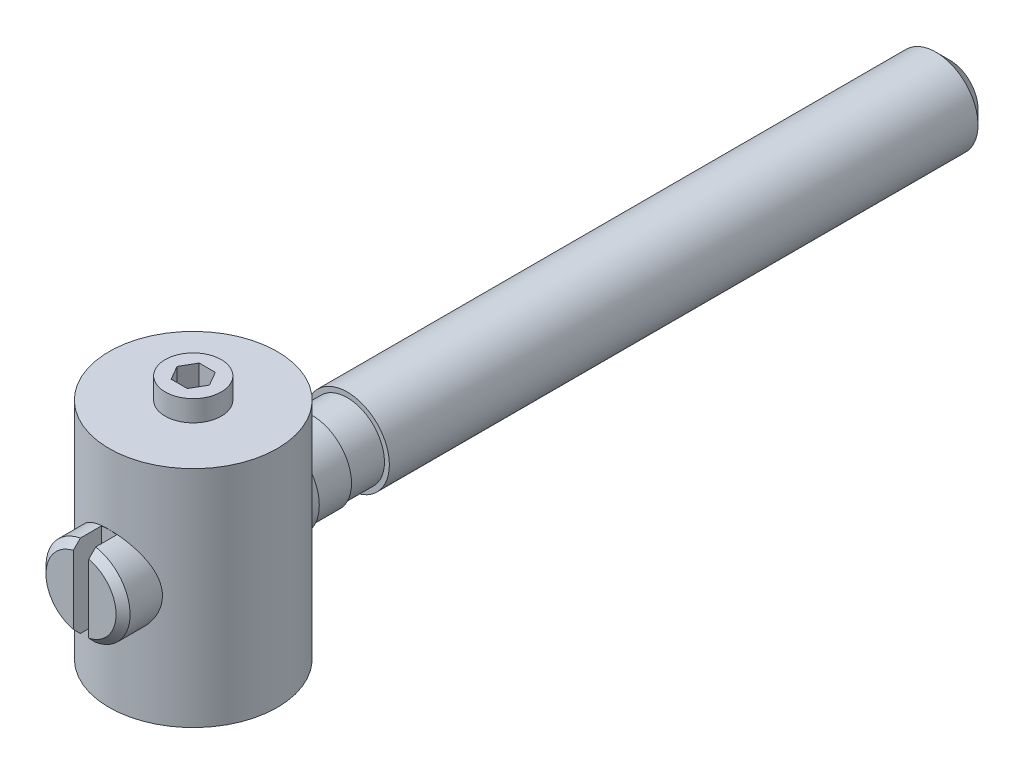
ISO-10303-21;
HEADER;
FILE_DESCRIPTION(('STEP AP214'),'2;1');
FILE_NAME('part.step','',(''),(''),'','','');
FILE_SCHEMA(('AUTOMOTIVE_DESIGN { 1 0 10303 214 1 1 1 1 }'));
ENDSEC;
DATA;
#1=APPLICATION_CONTEXT('core data for automotive mechanical design processes');
#2=APPLICATION_PROTOCOL_DEFINITION('international standard','automotive_design',2000,#1);
#3=PRODUCT_CONTEXT('',#1,'mechanical');
#4=PRODUCT('Part','Part','',(#3));
#5=PRODUCT_RELATED_PRODUCT_CATEGORY('part','',(#4));
#6=PRODUCT_DEFINITION_FORMATION('','',#4);
#7=PRODUCT_DEFINITION_CONTEXT('part definition',#1,'design');
#8=PRODUCT_DEFINITION('design','',#6,#7);
#9=PRODUCT_DEFINITION_SHAPE('','',#8);
#10=(LENGTH_UNIT() NAMED_UNIT(*) SI_UNIT(.MILLI.,.METRE.));
#11=(NAMED_UNIT(*) PLANE_ANGLE_UNIT() SI_UNIT($,.RADIAN.));
#12=(NAMED_UNIT(*) SI_UNIT($,.STERADIAN.) SOLID_ANGLE_UNIT());
#13=UNCERTAINTY_MEASURE_WITH_UNIT(LENGTH_MEASURE(1.E-05),#10,'distance_accuracy_value','');
#14=(GEOMETRIC_REPRESENTATION_CONTEXT(3) GLOBAL_UNCERTAINTY_ASSIGNED_CONTEXT((#13)) GLOBAL_UNIT_ASSIGNED_CONTEXT((#10,
#11,#12)) REPRESENTATION_CONTEXT('',''));
#15=CARTESIAN_POINT('',(0.,0.,0.));
#16=DIRECTION('',(0.,0.,1.));
#17=DIRECTION('',(1.,0.,0.));
#18=AXIS2_PLACEMENT_3D('',#15,#16,#17);
#19=CARTESIAN_POINT('',(-0.577350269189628,8.,-1.));
#20=DIRECTION('',(0.,-1.,0.));
#21=DIRECTION('',(1.,0.,0.));
#22=AXIS2_PLACEMENT_3D('',#19,#20,#21);
#23=PLANE('',#22);
#24=DIRECTION('',(-0.5,0.,0.866025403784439));
#25=VECTOR('',#24,1.);
#26=CARTESIAN_POINT('',(-0.577350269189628,8.,-1.));
#27=LINE('',#26,#25);
#28=CARTESIAN_POINT('',(-0.577350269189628,8.,-1.));
#29=VERTEX_POINT('',#28);
#30=CARTESIAN_POINT('',(-1.15470053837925,8.,0.));
#31=VERTEX_POINT('',#30);
#32=EDGE_CURVE('E366',#29,#31,#27,.T.);
#33=ORIENTED_EDGE('',*,*,#32,.T.);
#34=DIRECTION('',(0.5,0.,0.866025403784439));
#35=VECTOR('',#34,1.);
#36=CARTESIAN_POINT('',(-1.15470053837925,8.,0.));
#37=LINE('',#36,#35);
#38=CARTESIAN_POINT('',(-0.577350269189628,8.,1.));
#39=VERTEX_POINT('',#38);
#40=EDGE_CURVE('E363',#31,#39,#37,.T.);
#41=ORIENTED_EDGE('',*,*,#40,.T.);
#42=DIRECTION('',(1.,0.,0.));
#43=VECTOR('',#42,1.);
#44=CARTESIAN_POINT('',(-0.577350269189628,8.,1.));
#45=LINE('',#44,#43);
#46=CARTESIAN_POINT('',(0.577350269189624,8.,1.));
#47=VERTEX_POINT('',#46);
#48=EDGE_CURVE('E360',#39,#47,#45,.T.);
#49=ORIENTED_EDGE('',*,*,#48,.T.);
#50=DIRECTION('',(0.5,0.,-0.866025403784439));
#51=VECTOR('',#50,1.);
#52=CARTESIAN_POINT('',(0.577350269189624,8.,1.));
#53=LINE('',#52,#51);
#54=CARTESIAN_POINT('',(1.15470053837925,8.,0.));
#55=VERTEX_POINT('',#54);
#56=EDGE_CURVE('E357',#47,#55,#53,.T.);
#57=ORIENTED_EDGE('',*,*,#56,.T.);
#58=DIRECTION('',(-0.5,0.,-0.866025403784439));
#59=VECTOR('',#58,1.);
#60=CARTESIAN_POINT('',(1.15470053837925,8.,0.));
#61=LINE('',#60,#59);
#62=CARTESIAN_POINT('',(0.577350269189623,8.,-1.));
#63=VERTEX_POINT('',#62);
#64=EDGE_CURVE('E354',#55,#63,#61,.T.);
#65=ORIENTED_EDGE('',*,*,#64,.T.);
#66=DIRECTION('',(-1.,0.,0.));
#67=VECTOR('',#66,1.);
#68=CARTESIAN_POINT('',(0.577350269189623,8.,-1.));
#69=LINE('',#68,#67);
#70=EDGE_CURVE('E342',#63,#29,#69,.T.);
#71=ORIENTED_EDGE('',*,*,#70,.T.);
#72=EDGE_LOOP('',(#33,#41,#49,#57,#65,#71));
#73=FACE_BOUND('',#72,.T.);
#74=ADVANCED_FACE('F14',(#73),#23,.F.);
#75=CARTESIAN_POINT('',(-0.577350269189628,8.,1.));
#76=DIRECTION('',(0.,0.,1.));
#77=DIRECTION('',(1.,0.,0.));
#78=AXIS2_PLACEMENT_3D('',#75,#76,#77);
#79=PLANE('',#78);
#80=DIRECTION('',(1.,0.,0.));
#81=VECTOR('',#80,1.);
#82=CARTESIAN_POINT('',(-0.577350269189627,9.5,1.));
#83=LINE('',#82,#81);
#84=CARTESIAN_POINT('',(-0.577350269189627,9.5,1.));
#85=VERTEX_POINT('',#84);
#86=CARTESIAN_POINT('',(0.577350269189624,9.5,1.));
#87=VERTEX_POINT('',#86);
#88=EDGE_CURVE('E378',#85,#87,#83,.T.);
#89=ORIENTED_EDGE('',*,*,#88,.T.);
#90=DIRECTION('',(0.,1.,0.));
#91=VECTOR('',#90,1.);
#92=CARTESIAN_POINT('',(0.577350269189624,8.,1.));
#93=LINE('',#92,#91);
#94=EDGE_CURVE('E345',#47,#87,#93,.T.);
#95=ORIENTED_EDGE('',*,*,#94,.F.);
#96=ORIENTED_EDGE('',*,*,#48,.F.);
#97=DIRECTION('',(0.,1.,0.));
#98=VECTOR('',#97,1.);
#99=CARTESIAN_POINT('',(-0.577350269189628,8.,1.));
#100=LINE('',#99,#98);
#101=EDGE_CURVE('E343',#39,#85,#100,.T.);
#102=ORIENTED_EDGE('',*,*,#101,.T.);
#103=EDGE_LOOP('',(#89,#95,#96,#102));
#104=FACE_BOUND('',#103,.T.);
#105=ADVANCED_FACE('F615',(#104),#79,.F.);
#106=CARTESIAN_POINT('',(0.577350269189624,8.,1.));
#107=DIRECTION('',(0.866025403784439,0.,0.5));
#108=DIRECTION('',(0.5,0.,-0.866025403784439));
#109=AXIS2_PLACEMENT_3D('',#106,#107,#108);
#110=PLANE('',#109);
#111=DIRECTION('',(0.5,0.,-0.866025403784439));
#112=VECTOR('',#111,1.);
#113=CARTESIAN_POINT('',(0.577350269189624,9.5,1.));
#114=LINE('',#113,#112);
#115=CARTESIAN_POINT('',(1.15470053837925,9.5,0.));
#116=VERTEX_POINT('',#115);
#117=EDGE_CURVE('E375',#87,#116,#114,.T.);
#118=ORIENTED_EDGE('',*,*,#117,.T.);
#119=DIRECTION('',(0.,1.,0.));
#120=VECTOR('',#119,1.);
#121=CARTESIAN_POINT('',(1.15470053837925,8.,0.));
#122=LINE('',#121,#120);
#123=EDGE_CURVE('E347',#55,#116,#122,.T.);
#124=ORIENTED_EDGE('',*,*,#123,.F.);
#125=ORIENTED_EDGE('',*,*,#56,.F.);
#126=ORIENTED_EDGE('',*,*,#94,.T.);
#127=EDGE_LOOP('',(#118,#124,#125,#126));
#128=FACE_BOUND('',#127,.T.);
#129=ADVANCED_FACE('F624',(#128),#110,.F.);
#130=CARTESIAN_POINT('',(1.15470053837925,8.,0.));
#131=DIRECTION('',(0.866025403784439,0.,-0.5));
#132=DIRECTION('',(-0.5,0.,-0.866025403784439));
#133=AXIS2_PLACEMENT_3D('',#130,#131,#132);
#134=PLANE('',#133);
#135=DIRECTION('',(-0.5,0.,-0.866025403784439));
#136=VECTOR('',#135,1.);
#137=CARTESIAN_POINT('',(1.15470053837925,9.5,0.));
#138=LINE('',#137,#136);
#139=CARTESIAN_POINT('',(0.577350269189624,9.5,-1.));
#140=VERTEX_POINT('',#139);
#141=EDGE_CURVE('E372',#116,#140,#138,.T.);
#142=ORIENTED_EDGE('',*,*,#141,.T.);
#143=DIRECTION('',(0.,1.,0.));
#144=VECTOR('',#143,1.);
#145=CARTESIAN_POINT('',(0.577350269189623,8.,-1.));
#146=LINE('',#145,#144);
#147=EDGE_CURVE('E349',#63,#140,#146,.T.);
#148=ORIENTED_EDGE('',*,*,#147,.F.);
#149=ORIENTED_EDGE('',*,*,#64,.F.);
#150=ORIENTED_EDGE('',*,*,#123,.T.);
#151=EDGE_LOOP('',(#142,#148,#149,#150));
#152=FACE_BOUND('',#151,.T.);
#153=ADVANCED_FACE('F634',(#152),#134,.F.);
#154=CARTESIAN_POINT('',(0.577350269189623,8.,-1.));
#155=DIRECTION('',(0.,0.,-1.));
#156=DIRECTION('',(-1.,0.,0.));
#157=AXIS2_PLACEMENT_3D('',#154,#155,#156);
#158=PLANE('',#157);
#159=DIRECTION('',(-1.,0.,0.));
#160=VECTOR('',#159,1.);
#161=CARTESIAN_POINT('',(0.577350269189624,9.5,-1.));
#162=LINE('',#161,#160);
#163=CARTESIAN_POINT('',(-0.577350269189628,9.5,-1.));
#164=VERTEX_POINT('',#163);
#165=EDGE_CURVE('E369',#140,#164,#162,.T.);
#166=ORIENTED_EDGE('',*,*,#165,.T.);
#167=DIRECTION('',(0.,1.,0.));
#168=VECTOR('',#167,1.);
#169=CARTESIAN_POINT('',(-0.577350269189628,8.,-1.));
#170=LINE('',#169,#168);
#171=EDGE_CURVE('E337',#29,#164,#170,.T.);
#172=ORIENTED_EDGE('',*,*,#171,.F.);
#173=ORIENTED_EDGE('',*,*,#70,.F.);
#174=ORIENTED_EDGE('',*,*,#147,.T.);
#175=EDGE_LOOP('',(#166,#172,#173,#174));
#176=FACE_BOUND('',#175,.T.);
#177=ADVANCED_FACE('F644',(#176),#158,.F.);
#178=CARTESIAN_POINT('',(-0.577350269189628,8.,-1.));
#179=DIRECTION('',(-0.866025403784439,0.,-0.5));
#180=DIRECTION('',(-0.5,0.,0.866025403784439));
#181=AXIS2_PLACEMENT_3D('',#178,#179,#180);
#182=PLANE('',#181);
#183=DIRECTION('',(-0.5,0.,0.866025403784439));
#184=VECTOR('',#183,1.);
#185=CARTESIAN_POINT('',(-0.577350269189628,9.5,-1.));
#186=LINE('',#185,#184);
#187=CARTESIAN_POINT('',(-1.15470053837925,9.5,0.));
#188=VERTEX_POINT('',#187);
#189=EDGE_CURVE('E87',#164,#188,#186,.T.);
#190=ORIENTED_EDGE('',*,*,#189,.T.);
#191=DIRECTION('',(0.,1.,0.));
#192=VECTOR('',#191,1.);
#193=CARTESIAN_POINT('',(-1.15470053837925,8.,0.));
#194=LINE('',#193,#192);
#195=EDGE_CURVE('E340',#31,#188,#194,.T.);
#196=ORIENTED_EDGE('',*,*,#195,.F.);
#197=ORIENTED_EDGE('',*,*,#32,.F.);
#198=ORIENTED_EDGE('',*,*,#171,.T.);
#199=EDGE_LOOP('',(#190,#196,#197,#198));
#200=FACE_BOUND('',#199,.T.);
#201=ADVANCED_FACE('F654',(#200),#182,.F.);
#202=CARTESIAN_POINT('',(-1.15470053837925,8.,0.));
#203=DIRECTION('',(-0.866025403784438,0.,0.5));
#204=DIRECTION('',(0.5,0.,0.866025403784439));
#205=AXIS2_PLACEMENT_3D('',#202,#203,#204);
#206=PLANE('',#205);
#207=DIRECTION('',(0.5,0.,0.866025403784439));
#208=VECTOR('',#207,1.);
#209=CARTESIAN_POINT('',(-1.15470053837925,9.5,0.));
#210=LINE('',#209,#208);
#211=EDGE_CURVE('E381',#188,#85,#210,.T.);
#212=ORIENTED_EDGE('',*,*,#211,.T.);
#213=ORIENTED_EDGE('',*,*,#101,.F.);
#214=ORIENTED_EDGE('',*,*,#40,.F.);
#215=ORIENTED_EDGE('',*,*,#195,.T.);
#216=EDGE_LOOP('',(#212,#213,#214,#215));
#217=FACE_BOUND('',#216,.T.);
#218=ADVANCED_FACE('F663',(#217),#206,.F.);
#219=CARTESIAN_POINT('',(0.,9.5,0.));
#220=DIRECTION('',(0.,-1.,0.));
#221=DIRECTION('',(1.,0.,0.));
#222=AXIS2_PLACEMENT_3D('',#219,#220,#221);
#223=PLANE('',#222);
#224=ORIENTED_EDGE('',*,*,#211,.F.);
#225=ORIENTED_EDGE('',*,*,#189,.F.);
#226=ORIENTED_EDGE('',*,*,#165,.F.);
#227=ORIENTED_EDGE('',*,*,#141,.F.);
#228=ORIENTED_EDGE('',*,*,#117,.F.);
#229=ORIENTED_EDGE('',*,*,#88,.F.);
#230=EDGE_LOOP('',(#224,#225,#226,#227,#228,#229));
#231=FACE_BOUND('',#230,.T.);
#232=CARTESIAN_POINT('',(0.,9.5,0.));
#233=DIRECTION('',(0.,-1.,0.));
#234=DIRECTION('',(1.,0.,0.));
#235=AXIS2_PLACEMENT_3D('',#232,#233,#234);
#236=CIRCLE('',#235,2.);
#237=CARTESIAN_POINT('',(2.,9.5,0.));
#238=VERTEX_POINT('',#237);
#239=EDGE_CURVE('E332',#238,#238,#236,.T.);
#240=ORIENTED_EDGE('',*,*,#239,.F.);
#241=EDGE_LOOP('',(#240));
#242=FACE_BOUND('',#241,.T.);
#243=ADVANCED_FACE('F409',(#231,#242),#223,.F.);
#244=CARTESIAN_POINT('',(0.,5.5,0.));
#245=DIRECTION('',(0.,-1.,0.));
#246=DIRECTION('',(1.,0.,0.));
#247=AXIS2_PLACEMENT_3D('',#244,#245,#246);
#248=CYLINDRICAL_SURFACE('',#247,2.);
#249=ORIENTED_EDGE('',*,*,#239,.T.);
#250=EDGE_LOOP('',(#249));
#251=FACE_BOUND('',#250,.T.);
#252=CARTESIAN_POINT('',(0.,8.,0.));
#253=DIRECTION('',(0.,-1.,0.));
#254=DIRECTION('',(1.,0.,0.));
#255=AXIS2_PLACEMENT_3D('',#252,#253,#254);
#256=CIRCLE('',#255,2.);
#257=CARTESIAN_POINT('',(2.,8.,0.));
#258=VERTEX_POINT('',#257);
#259=EDGE_CURVE('E330',#258,#258,#256,.T.);
#260=ORIENTED_EDGE('',*,*,#259,.F.);
#261=EDGE_LOOP('',(#260));
#262=FACE_BOUND('',#261,.T.);
#263=ADVANCED_FACE('F403',(#251,#262),#248,.T.);
#264=CARTESIAN_POINT('',(0.,8.,0.));
#265=DIRECTION('',(0.,-1.,0.));
#266=DIRECTION('',(1.,0.,0.));
#267=AXIS2_PLACEMENT_3D('',#264,#265,#266);
#268=PLANE('',#267);
#269=CARTESIAN_POINT('',(0.,8.,0.));
#270=DIRECTION('',(0.,-1.,0.));
#271=DIRECTION('',(1.,0.,0.));
#272=AXIS2_PLACEMENT_3D('',#269,#270,#271);
#273=CIRCLE('',#272,6.);
#274=CARTESIAN_POINT('',(6.,8.,0.));
#275=VERTEX_POINT('',#274);
#276=EDGE_CURVE('E387',#275,#275,#273,.T.);
#277=ORIENTED_EDGE('',*,*,#276,.F.);
#278=EDGE_LOOP('',(#277));
#279=FACE_BOUND('',#278,.T.);
#280=ORIENTED_EDGE('',*,*,#259,.T.);
#281=EDGE_LOOP('',(#280));
#282=FACE_BOUND('',#281,.T.);
#283=ADVANCED_FACE('F397',(#279,#282),#268,.F.);
#284=CARTESIAN_POINT('',(0.,-8.,0.));
#285=DIRECTION('',(0.,-1.,0.));
#286=DIRECTION('',(1.,0.,0.));
#287=AXIS2_PLACEMENT_3D('',#284,#285,#286);
#288=PLANE('',#287);
#289=CARTESIAN_POINT('',(0.,-8.,0.));
#290=DIRECTION('',(0.,-1.,0.));
#291=DIRECTION('',(1.,0.,0.));
#292=AXIS2_PLACEMENT_3D('',#289,#290,#291);
#293=CIRCLE('',#292,6.);
#294=CARTESIAN_POINT('',(6.,-8.,0.));
#295=VERTEX_POINT('',#294);
#296=EDGE_CURVE('E385',#295,#295,#293,.T.);
#297=ORIENTED_EDGE('',*,*,#296,.T.);
#298=EDGE_LOOP('',(#297));
#299=FACE_BOUND('',#298,.T.);
#300=ADVANCED_FACE('F257',(#299),#288,.T.);
#301=CARTESIAN_POINT('',(0.,-8.,0.));
#302=DIRECTION('',(0.,1.,0.));
#303=DIRECTION('',(-1.,0.,0.));
#304=AXIS2_PLACEMENT_3D('',#301,#302,#303);
#305=CYLINDRICAL_SURFACE('',#304,6.);
#306=CARTESIAN_POINT('',(0.,-3.,6.));
#307=CARTESIAN_POINT('',(0.0788941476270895,-2.99999916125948,5.99999934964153));
#308=CARTESIAN_POINT('',(0.157796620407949,-2.99688205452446,5.99843869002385));
#309=CARTESIAN_POINT('',(0.315001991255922,-2.98446072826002,5.99224358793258));
#310=CARTESIAN_POINT('',(0.393304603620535,-2.97515372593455,5.98760776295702));
#311=CARTESIAN_POINT('',(0.626628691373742,-2.93804214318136,5.96921978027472));
#312=CARTESIAN_POINT('',(0.779952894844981,-2.90104717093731,5.95098734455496));
#313=CARTESIAN_POINT('',(1.07683586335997,-2.80441822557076,5.90448966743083));
#314=CARTESIAN_POINT('',(1.22043005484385,-2.74487223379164,5.87626344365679));
#315=CARTESIAN_POINT('',(1.49540820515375,-2.60528874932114,5.81237302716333));
#316=CARTESIAN_POINT('',(1.62679312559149,-2.52525287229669,5.77670942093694));
#317=CARTESIAN_POINT('',(1.88252701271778,-2.34144601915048,5.69868752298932));
#318=CARTESIAN_POINT('',(2.0059694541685,-2.23653205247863,5.65605474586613));
#319=CARTESIAN_POINT('',(2.23433451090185,-2.00844407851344,5.5698003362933));
#320=CARTESIAN_POINT('',(2.3392430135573,-1.88525628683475,5.52617797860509));
#321=CARTESIAN_POINT('',(2.53576864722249,-1.61251563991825,5.43896347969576));
#322=CARTESIAN_POINT('',(2.62572411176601,-1.46165902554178,5.39563602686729));
#323=CARTESIAN_POINT('',(2.7403403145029,-1.22404914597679,5.33782449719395));
#324=CARTESIAN_POINT('',(2.77516786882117,-1.14292907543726,5.31974570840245));
#325=CARTESIAN_POINT('',(2.83769299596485,-0.977399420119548,5.28665768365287));
#326=CARTESIAN_POINT('',(2.86539478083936,-0.892991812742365,5.27164663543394));
#327=CARTESIAN_POINT('',(2.91188280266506,-0.72660420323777,5.24610341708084));
#328=CARTESIAN_POINT('',(2.93110042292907,-0.644777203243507,5.23535838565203));
#329=CARTESIAN_POINT('',(2.9626355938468,-0.4794450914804,5.21757784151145));
#330=CARTESIAN_POINT('',(2.97495680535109,-0.395940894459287,5.21054036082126));
#331=CARTESIAN_POINT('',(2.99251382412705,-0.227993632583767,5.20047756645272));
#332=CARTESIAN_POINT('',(2.99775389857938,-0.143551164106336,5.19744983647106));
#333=CARTESIAN_POINT('',(3.00108452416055,0.0254936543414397,5.19552555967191));
#334=CARTESIAN_POINT('',(2.99917575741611,0.110095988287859,5.19662861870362));
#335=CARTESIAN_POINT('',(2.98404973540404,0.342753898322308,5.20534668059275));
#336=CARTESIAN_POINT('',(2.96335042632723,0.490244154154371,5.21726794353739));
#337=CARTESIAN_POINT('',(2.90082280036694,0.779193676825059,5.25228182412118));
#338=CARTESIAN_POINT('',(2.85898775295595,0.920651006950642,5.2753780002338));
#339=CARTESIAN_POINT('',(2.75462843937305,1.19767965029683,5.33062568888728));
#340=CARTESIAN_POINT('',(2.69164495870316,1.33303711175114,5.36297559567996));
#341=CARTESIAN_POINT('',(2.54712530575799,1.59190496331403,5.43310175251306));
#342=CARTESIAN_POINT('',(2.46558080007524,1.71540999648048,5.47088043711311));
#343=CARTESIAN_POINT('',(2.27419808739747,1.96356309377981,5.55339485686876));
#344=CARTESIAN_POINT('',(2.16208335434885,2.0863704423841,5.59840533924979));
#345=CARTESIAN_POINT('',(1.91866675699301,2.31220643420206,5.6864286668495));
#346=CARTESIAN_POINT('',(1.78735577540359,2.41522562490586,5.72944054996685));
#347=CARTESIAN_POINT('',(1.50154951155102,2.60305693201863,5.81105962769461));
#348=CARTESIAN_POINT('',(1.3462607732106,2.68680140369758,5.84936952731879));
#349=CARTESIAN_POINT('',(1.02139864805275,2.82629110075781,5.91473643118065));
#350=CARTESIAN_POINT('',(0.851836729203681,2.88205855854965,5.94180236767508));
#351=CARTESIAN_POINT('',(0.518299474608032,2.95942620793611,5.97973001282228));
#352=CARTESIAN_POINT('',(0.355024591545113,2.98347370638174,5.99174814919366));
#353=CARTESIAN_POINT('',(0.0263387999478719,3.00439419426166,6.00219040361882));
#354=CARTESIAN_POINT('',(-0.13907105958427,3.00128005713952,6.00062096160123));
#355=CARTESIAN_POINT('',(-0.453698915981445,2.96937993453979,5.98473576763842));
#356=CARTESIAN_POINT('',(-0.60317822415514,2.94260240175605,5.97141737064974));
#357=CARTESIAN_POINT('',(-0.895220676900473,2.86728578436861,5.93466513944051));
#358=CARTESIAN_POINT('',(-1.03778305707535,2.81874430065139,5.91123019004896));
#359=CARTESIAN_POINT('',(-1.31666582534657,2.7000046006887,5.85552754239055));
#360=CARTESIAN_POINT('',(-1.45269119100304,2.62922684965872,5.82302645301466));
#361=CARTESIAN_POINT('',(-1.71138408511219,2.46867739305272,5.75231922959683));
#362=CARTESIAN_POINT('',(-1.83404588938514,2.37889759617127,5.71411066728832));
#363=CARTESIAN_POINT('',(-2.07530306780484,2.17271872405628,5.63124663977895));
#364=CARTESIAN_POINT('',(-2.19231623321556,2.05457139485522,5.58632654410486));
#365=CARTESIAN_POINT('',(-2.40556896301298,1.8002245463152,5.49787174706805));
#366=CARTESIAN_POINT('',(-2.50179415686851,1.66401264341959,5.45433802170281));
#367=CARTESIAN_POINT('',(-2.675123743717,1.36906903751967,5.3715357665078));
#368=CARTESIAN_POINT('',(-2.75107648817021,1.20956620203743,5.33257588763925));
#369=CARTESIAN_POINT('',(-2.87424847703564,0.87746979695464,5.26722216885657));
#370=CARTESIAN_POINT('',(-2.92150474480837,0.704893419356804,5.24081214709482));
#371=CARTESIAN_POINT('',(-2.98158506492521,0.369269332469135,5.2068450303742));
#372=CARTESIAN_POINT('',(-2.997278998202,0.206897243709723,5.19772150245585));
#373=CARTESIAN_POINT('',(-3.00206745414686,-0.118341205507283,5.19496064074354));
#374=CARTESIAN_POINT('',(-2.99117350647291,-0.28120732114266,5.20131659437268));
#375=CARTESIAN_POINT('',(-2.94577840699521,-0.586450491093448,5.227135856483));
#376=CARTESIAN_POINT('',(-2.91362505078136,-0.72930136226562,5.24529281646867));
#377=CARTESIAN_POINT('',(-2.82952596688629,-1.0074244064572,5.29113050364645));
#378=CARTESIAN_POINT('',(-2.77757387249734,-1.14269412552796,5.3188142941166));
#379=CARTESIAN_POINT('',(-2.65144766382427,-1.41187436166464,5.38285583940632));
#380=CARTESIAN_POINT('',(-2.57601505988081,-1.54508296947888,5.41967139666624));
#381=CARTESIAN_POINT('',(-2.40645126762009,-1.7978243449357,5.49706022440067));
#382=CARTESIAN_POINT('',(-2.31231035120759,-1.9173499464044,5.5376354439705));
#383=CARTESIAN_POINT('',(-2.094616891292,-2.15442285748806,5.62386853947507));
#384=CARTESIAN_POINT('',(-1.96888052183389,-2.26996512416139,5.66954494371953));
#385=CARTESIAN_POINT('',(-1.69843715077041,-2.47880114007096,5.75633712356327));
#386=CARTESIAN_POINT('',(-1.55371998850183,-2.57208289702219,5.79745043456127));
#387=CARTESIAN_POINT('',(-1.32452333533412,-2.69317818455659,5.85251406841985));
#388=CARTESIAN_POINT('',(-1.24575314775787,-2.73052020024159,5.86982524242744));
#389=CARTESIAN_POINT('',(-1.08479725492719,-2.79836167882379,5.90168845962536));
#390=CARTESIAN_POINT('',(-1.00261324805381,-2.82886449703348,5.91624185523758));
#391=CARTESIAN_POINT('',(-0.835616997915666,-2.88260725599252,5.94212690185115));
#392=CARTESIAN_POINT('',(-0.750810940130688,-2.90586304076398,5.95346557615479));
#393=CARTESIAN_POINT('',(-0.579142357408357,-2.94488257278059,5.97260771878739));
#394=CARTESIAN_POINT('',(-0.492281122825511,-2.96065089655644,5.9804133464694));
#395=CARTESIAN_POINT('',(-0.337824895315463,-2.98168467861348,5.99085829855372));
#396=CARTESIAN_POINT('',(-0.270495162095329,-2.98854691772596,5.99428035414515));
#397=CARTESIAN_POINT('',(-0.13544567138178,-2.99770500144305,5.99885151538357));
#398=CARTESIAN_POINT('',(-0.067725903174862,-3.00000072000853,6.00000055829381));
#399=CARTESIAN_POINT('',(0.,-3.,6.));
#400=B_SPLINE_CURVE_WITH_KNOTS('',3,(#306,#307,#308,#309,#310,#311,#312,#313,#314,#315,#316,
#317,#318,#319,#320,#321,#322,#323,#324,#325,#326,#327,#328,#329,#330,#331,#332,#333,#334,#335,
#336,#337,#338,#339,#340,#341,#342,#343,#344,#345,#346,#347,#348,#349,#350,#351,#352,#353,#354,
#355,#356,#357,#358,#359,#360,#361,#362,#363,#364,#365,#366,#367,#368,#369,#370,#371,#372,#373,
#374,#375,#376,#377,#378,#379,#380,#381,#382,#383,#384,#385,#386,#387,#388,#389,#390,#391,#392,
#393,#394,#395,#396,#397,#398,#399),.UNSPECIFIED.,.T.,.F.,(4,2,2,2,2,2,2,2,2,2,2,2,2,2,2,2,2,2,
2,2,2,2,2,2,2,2,2,2,2,2,2,2,2,2,2,2,2,2,2,2,2,2,2,2,2,2,4),(0.,0.236611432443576,
0.4733293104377,0.947100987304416,1.41904300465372,1.89094781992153,2.39140181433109,
2.89223525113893,3.4319083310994,3.70192714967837,3.97178599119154,4.22563720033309,
4.47935352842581,4.73291689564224,4.98645606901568,5.43238672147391,5.87845946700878,
6.33492255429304,6.79159098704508,7.30616358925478,7.82098138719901,8.35970601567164,
8.89800185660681,9.39171406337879,9.88519228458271,10.3404225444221,10.7957029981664,
11.2640010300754,11.7324988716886,12.2470036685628,12.7618630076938,13.3016558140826,
13.8407507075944,14.3280945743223,14.8152271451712,15.2559532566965,15.6968212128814,
16.1673090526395,16.6380421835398,17.1659726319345,17.6941868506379,17.9605054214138,
18.2266930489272,18.4922945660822,18.7577335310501,18.9608446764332,19.1639614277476),.UNSPECIFIED.);
#401=CARTESIAN_POINT('',(0.,-3.,6.));
#402=VERTEX_POINT('',#401);
#403=EDGE_CURVE('E238',#402,#402,#400,.T.);
#404=ORIENTED_EDGE('',*,*,#403,.F.);
#405=EDGE_LOOP('',(#404));
#406=FACE_BOUND('',#405,.T.);
#407=ORIENTED_EDGE('',*,*,#296,.F.);
#408=EDGE_LOOP('',(#407));
#409=FACE_BOUND('',#408,.T.);
#410=ORIENTED_EDGE('',*,*,#276,.T.);
#411=EDGE_LOOP('',(#410));
#412=FACE_BOUND('',#411,.T.);
#413=CARTESIAN_POINT('',(-0.249443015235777,-2.98961171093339,-5.99481260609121));
#414=CARTESIAN_POINT('',(-0.330004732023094,-2.98290238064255,-5.99147459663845));
#415=CARTESIAN_POINT('',(-0.410210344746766,-2.9729193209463,-5.9864967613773));
#416=CARTESIAN_POINT('',(-0.569274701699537,-2.94659155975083,-5.97346181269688));
#417=CARTESIAN_POINT('',(-0.648134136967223,-2.93025023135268,-5.96540633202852));
#418=CARTESIAN_POINT('',(-0.803591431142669,-2.89147571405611,-5.94645720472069));
#419=CARTESIAN_POINT('',(-0.880198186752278,-2.86907155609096,-5.93557709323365));
#420=CARTESIAN_POINT('',(-1.03101013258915,-2.81839560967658,-5.91124875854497));
#421=CARTESIAN_POINT('',(-1.10521507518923,-2.79012321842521,-5.89780027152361));
#422=CARTESIAN_POINT('',(-1.3232618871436,-2.6970128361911,-5.85413093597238));
#423=CARTESIAN_POINT('',(-1.46294865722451,-2.62377717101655,-5.82053324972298));
#424=CARTESIAN_POINT('',(-1.72813965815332,-2.45726165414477,-5.74739463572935));
#425=CARTESIAN_POINT('',(-1.85362624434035,-2.36395727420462,-5.70784645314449));
#426=CARTESIAN_POINT('',(-2.09631897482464,-2.15246230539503,-5.62343784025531));
#427=CARTESIAN_POINT('',(-2.21235682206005,-2.0329990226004,-5.57839915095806));
#428=CARTESIAN_POINT('',(-2.42343129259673,-1.77613061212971,-5.49000039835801));
#429=CARTESIAN_POINT('',(-2.51845793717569,-1.63871700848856,-5.44664114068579));
#430=CARTESIAN_POINT('',(-2.68891933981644,-1.34176609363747,-5.36461418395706));
#431=CARTESIAN_POINT('',(-2.76324651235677,-1.18150009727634,-5.32625566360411));
#432=CARTESIAN_POINT('',(-2.88302999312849,-0.848170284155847,-5.26239681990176));
#433=CARTESIAN_POINT('',(-2.92852409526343,-0.675123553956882,-5.2368796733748));
#434=CARTESIAN_POINT('',(-2.98508038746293,-0.33956679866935,-5.20482957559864));
#435=CARTESIAN_POINT('',(-2.99911195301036,-0.177715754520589,-5.19666371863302));
#436=CARTESIAN_POINT('',(-3.00080498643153,0.146144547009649,-5.19568908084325));
#437=CARTESIAN_POINT('',(-2.98847637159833,0.30815372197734,-5.20287452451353));
#438=CARTESIAN_POINT('',(-2.94054735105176,0.612110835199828,-5.23008745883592));
#439=CARTESIAN_POINT('',(-2.90718475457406,0.754536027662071,-5.24887684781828));
#440=CARTESIAN_POINT('',(-2.82077935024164,1.03164067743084,-5.29581030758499));
#441=CARTESIAN_POINT('',(-2.76773012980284,1.16631759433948,-5.32395742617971));
#442=CARTESIAN_POINT('',(-2.63918949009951,1.43470666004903,-5.38889663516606));
#443=CARTESIAN_POINT('',(-2.56236570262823,1.56766275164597,-5.4261626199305));
#444=CARTESIAN_POINT('',(-2.38999637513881,1.8196827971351,-5.5042586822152));
#445=CARTESIAN_POINT('',(-2.29444154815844,1.93873981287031,-5.5450905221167));
#446=CARTESIAN_POINT('',(-2.0738880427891,2.17441373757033,-5.63157604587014));
#447=CARTESIAN_POINT('',(-1.94673190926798,2.28902254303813,-5.67722023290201));
#448=CARTESIAN_POINT('',(-1.67350278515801,2.49573457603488,-5.76366699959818));
#449=CARTESIAN_POINT('',(-1.52741754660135,2.58782311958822,-5.80446641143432));
#450=CARTESIAN_POINT('',(-1.29660432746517,2.70672716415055,-5.85876618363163));
#451=CARTESIAN_POINT('',(-1.21754163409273,2.74321299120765,-5.87574440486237));
#452=CARTESIAN_POINT('',(-1.0560802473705,2.80932188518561,-5.90689721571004));
#453=CARTESIAN_POINT('',(-0.97368327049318,2.8389484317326,-5.9210732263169));
#454=CARTESIAN_POINT('',(-0.806386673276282,2.89091640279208,-5.94616533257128));
#455=CARTESIAN_POINT('',(-0.721494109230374,2.91327654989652,-5.95708979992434));
#456=CARTESIAN_POINT('',(-0.549753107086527,2.95050469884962,-5.9753839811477));
#457=CARTESIAN_POINT('',(-0.462906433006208,2.96537919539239,-5.98275677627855));
#458=CARTESIAN_POINT('',(-0.354542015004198,2.97905143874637,-5.98955282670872));
#459=CARTESIAN_POINT('',(-0.333551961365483,2.98147453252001,-5.99075847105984));
#460=CARTESIAN_POINT('',(-0.291530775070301,2.98587593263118,-5.99295011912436));
#461=CARTESIAN_POINT('',(-0.270499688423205,2.98785459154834,-5.99393629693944));
#462=CARTESIAN_POINT('',(-0.249443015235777,2.98961171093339,-5.99481260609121));
#463=B_SPLINE_CURVE_WITH_KNOTS('',3,(#413,#414,#415,#416,#417,#418,#419,#420,#421,#422,#423,
#424,#425,#426,#427,#428,#429,#430,#431,#432,#433,#434,#435,#436,#437,#438,#439,#440,#441,#442,
#443,#444,#445,#446,#447,#448,#449,#450,#451,#452,#453,#454,#455,#456,#457,#458,#459,#460,#461,
#462),.UNSPECIFIED.,.F.,.F.,(4,2,2,2,2,2,2,2,2,2,2,2,2,2,2,2,2,2,2,2,2,2,2,2,4),(0.,
0.242622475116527,0.485116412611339,0.726469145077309,0.967846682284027,1.4493301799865,
1.93140553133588,2.44673475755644,2.9623082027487,3.50169408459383,4.04037147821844,
4.52558194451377,5.01060989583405,5.45115857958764,5.89185089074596,6.36402161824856,
6.83642704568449,7.36553436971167,7.89498577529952,8.16082401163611,8.42652709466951,
8.6915400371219,8.9563226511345,9.01981077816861,9.08324835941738),.UNSPECIFIED.);
#464=CARTESIAN_POINT('',(-0.249443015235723,-2.98961171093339,-5.99481260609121));
#465=VERTEX_POINT('',#464);
#466=CARTESIAN_POINT('',(-0.249443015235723,2.9896117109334,-5.99481260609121));
#467=VERTEX_POINT('',#466);
#468=EDGE_CURVE('E9',#465,#467,#463,.T.);
#469=ORIENTED_EDGE('',*,*,#468,.F.);
#470=DIRECTION('',(0.,1.,0.));
#471=VECTOR('',#470,1.);
#472=CARTESIAN_POINT('',(-0.249443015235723,-8.,-5.99481260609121));
#473=LINE('',#472,#471);
#474=CARTESIAN_POINT('',(-0.2494430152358,-2.78886682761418,-5.99481260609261));
#475=VERTEX_POINT('',#474);
#476=EDGE_CURVE('E144',#475,#465,#473,.F.);
#477=ORIENTED_EDGE('',*,*,#476,.F.);
#478=CARTESIAN_POINT('',(0.249443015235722,-2.78886682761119,-5.99481260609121));
#479=CARTESIAN_POINT('',(0.228607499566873,-2.79073048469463,-5.99567959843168));
#480=CARTESIAN_POINT('',(0.207746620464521,-2.79236089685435,-5.99643870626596));
#481=CARTESIAN_POINT('',(0.166025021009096,-2.7951514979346,-5.99773876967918));
#482=CARTESIAN_POINT('',(0.1451643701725,-2.79631254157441,-5.99828012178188));
#483=CARTESIAN_POINT('',(0.103453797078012,-2.79816589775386,-5.99914472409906));
#484=CARTESIAN_POINT('',(0.0826039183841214,-2.79885901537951,-5.999468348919));
#485=CARTESIAN_POINT('',(0.0411692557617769,-2.7997729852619,-5.9998947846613));
#486=CARTESIAN_POINT('',(0.0205846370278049,-2.80000000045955,-6.00000047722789));
#487=CARTESIAN_POINT('',(-0.0209746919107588,-2.79999999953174,-5.99999951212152));
#488=CARTESIAN_POINT('',(-0.0419494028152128,-2.79976429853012,-5.99988879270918));
#489=CARTESIAN_POINT('',(-0.0836602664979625,-2.79882679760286,-5.9994506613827));
#490=CARTESIAN_POINT('',(-0.10439655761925,-2.79813004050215,-5.99912559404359));
#491=CARTESIAN_POINT('',(-0.145863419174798,-2.79627519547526,-5.99826105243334));
#492=CARTESIAN_POINT('',(-0.166593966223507,-2.79511667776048,-5.99772137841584));
#493=CARTESIAN_POINT('',(-0.208039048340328,-2.79233802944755,-5.99642770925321));
#494=CARTESIAN_POINT('',(-0.228753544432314,-2.7907174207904,-5.99567349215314));
#495=CARTESIAN_POINT('',(-0.249443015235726,-2.78886682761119,-5.99481260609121));
#496=B_SPLINE_CURVE_WITH_KNOTS('',3,(#478,#479,#480,#481,#482,#483,#484,#485,#486,#487,#488,
#489,#490,#491,#492,#493,#494,#495),.UNSPECIFIED.,.F.,.F.,(4,2,2,2,2,2,2,2,4),(0.,
0.0628083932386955,0.125501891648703,0.188087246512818,0.249839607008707,0.312762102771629,
0.375007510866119,0.437310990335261,0.499679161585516),.UNSPECIFIED.);
#497=CARTESIAN_POINT('',(0.249443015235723,-2.78886682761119,-5.99481260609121));
#498=VERTEX_POINT('',#497);
#499=EDGE_CURVE('E145',#498,#475,#496,.T.);
#500=ORIENTED_EDGE('',*,*,#499,.F.);
#501=DIRECTION('',(0.,1.,0.));
#502=VECTOR('',#501,1.);
#503=CARTESIAN_POINT('',(0.249443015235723,-8.,-5.99481260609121));
#504=LINE('',#503,#502);
#505=CARTESIAN_POINT('',(0.249443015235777,-2.98961171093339,-5.99481260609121));
#506=VERTEX_POINT('',#505);
#507=EDGE_CURVE('E274',#506,#498,#504,.T.);
#508=ORIENTED_EDGE('',*,*,#507,.F.);
#509=CARTESIAN_POINT('',(0.249443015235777,2.98961171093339,-5.99481260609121));
#510=CARTESIAN_POINT('',(0.330004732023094,2.98290238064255,-5.99147459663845));
#511=CARTESIAN_POINT('',(0.410210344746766,2.9729193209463,-5.9864967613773));
#512=CARTESIAN_POINT('',(0.569274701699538,2.94659155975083,-5.97346181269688));
#513=CARTESIAN_POINT('',(0.648134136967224,2.93025023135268,-5.96540633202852));
#514=CARTESIAN_POINT('',(0.80359143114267,2.89147571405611,-5.94645720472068));
#515=CARTESIAN_POINT('',(0.880198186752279,2.86907155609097,-5.93557709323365));
#516=CARTESIAN_POINT('',(1.03101013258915,2.81839560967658,-5.91124875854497));
#517=CARTESIAN_POINT('',(1.10521507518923,2.79012321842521,-5.89780027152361));
#518=CARTESIAN_POINT('',(1.3232618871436,2.6970128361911,-5.85413093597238));
#519=CARTESIAN_POINT('',(1.46294865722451,2.62377717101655,-5.82053324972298));
#520=CARTESIAN_POINT('',(1.72813965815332,2.45726165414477,-5.74739463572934));
#521=CARTESIAN_POINT('',(1.85362624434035,2.36395727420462,-5.70784645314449));
#522=CARTESIAN_POINT('',(2.09631897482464,2.15246230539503,-5.62343784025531));
#523=CARTESIAN_POINT('',(2.21235682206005,2.0329990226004,-5.57839915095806));
#524=CARTESIAN_POINT('',(2.42343129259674,1.77613061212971,-5.49000039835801));
#525=CARTESIAN_POINT('',(2.5184579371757,1.63871700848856,-5.44664114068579));
#526=CARTESIAN_POINT('',(2.68891933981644,1.34176609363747,-5.36461418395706));
#527=CARTESIAN_POINT('',(2.76324651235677,1.18150009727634,-5.32625566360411));
#528=CARTESIAN_POINT('',(2.88302999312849,0.848170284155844,-5.26239681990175));
#529=CARTESIAN_POINT('',(2.92852409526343,0.675123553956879,-5.2368796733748));
#530=CARTESIAN_POINT('',(2.98508038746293,0.339566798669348,-5.20482957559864));
#531=CARTESIAN_POINT('',(2.99911195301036,0.177715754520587,-5.19666371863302));
#532=CARTESIAN_POINT('',(3.00080498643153,-0.14614454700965,-5.19568908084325));
#533=CARTESIAN_POINT('',(2.98847637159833,-0.308153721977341,-5.20287452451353));
#534=CARTESIAN_POINT('',(2.94054735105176,-0.612110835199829,-5.23008745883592));
#535=CARTESIAN_POINT('',(2.90718475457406,-0.754536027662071,-5.24887684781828));
#536=CARTESIAN_POINT('',(2.82077935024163,-1.03164067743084,-5.29581030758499));
#537=CARTESIAN_POINT('',(2.76773012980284,-1.16631759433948,-5.32395742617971));
#538=CARTESIAN_POINT('',(2.63918949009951,-1.43470666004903,-5.38889663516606));
#539=CARTESIAN_POINT('',(2.56236570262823,-1.56766275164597,-5.4261626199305));
#540=CARTESIAN_POINT('',(2.3899963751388,-1.8196827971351,-5.50425868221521));
#541=CARTESIAN_POINT('',(2.29444154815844,-1.93873981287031,-5.54509052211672));
#542=CARTESIAN_POINT('',(2.0738880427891,-2.17441373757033,-5.63157604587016));
#543=CARTESIAN_POINT('',(1.94673190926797,-2.28902254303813,-5.67722023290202));
#544=CARTESIAN_POINT('',(1.673502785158,-2.49573457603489,-5.76366699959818));
#545=CARTESIAN_POINT('',(1.52741754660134,-2.58782311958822,-5.80446641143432));
#546=CARTESIAN_POINT('',(1.29660432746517,-2.70672716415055,-5.85876618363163));
#547=CARTESIAN_POINT('',(1.21754163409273,-2.74321299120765,-5.87574440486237));
#548=CARTESIAN_POINT('',(1.0560802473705,-2.80932188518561,-5.90689721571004));
#549=CARTESIAN_POINT('',(0.973683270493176,-2.8389484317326,-5.92107322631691));
#550=CARTESIAN_POINT('',(0.806386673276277,-2.89091640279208,-5.94616533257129));
#551=CARTESIAN_POINT('',(0.72149410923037,-2.91327654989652,-5.95708979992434));
#552=CARTESIAN_POINT('',(0.549753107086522,-2.95050469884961,-5.9753839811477));
#553=CARTESIAN_POINT('',(0.462906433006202,-2.96537919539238,-5.98275677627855));
#554=CARTESIAN_POINT('',(0.354542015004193,-2.97905143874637,-5.98955282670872));
#555=CARTESIAN_POINT('',(0.333551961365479,-2.98147453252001,-5.99075847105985));
#556=CARTESIAN_POINT('',(0.2915307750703,-2.98587593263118,-5.99295011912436));
#557=CARTESIAN_POINT('',(0.270499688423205,-2.98785459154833,-5.99393629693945));
#558=CARTESIAN_POINT('',(0.249443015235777,-2.98961171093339,-5.99481260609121));
#559=B_SPLINE_CURVE_WITH_KNOTS('',3,(#509,#510,#511,#512,#513,#514,#515,#516,#517,#518,#519,
#520,#521,#522,#523,#524,#525,#526,#527,#528,#529,#530,#531,#532,#533,#534,#535,#536,#537,#538,
#539,#540,#541,#542,#543,#544,#545,#546,#547,#548,#549,#550,#551,#552,#553,#554,#555,#556,#557,
#558),.UNSPECIFIED.,.F.,.F.,(4,2,2,2,2,2,2,2,2,2,2,2,2,2,2,2,2,2,2,2,2,2,2,2,4),(0.,
0.242622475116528,0.48511641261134,0.726469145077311,0.967846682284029,1.44933017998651,
1.93140553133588,2.44673475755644,2.9623082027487,3.50169408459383,4.04037147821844,
4.52558194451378,5.01060989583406,5.45115857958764,5.89185089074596,6.36402161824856,
6.8364270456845,7.36553436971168,7.89498577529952,8.16082401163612,8.42652709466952,
8.6915400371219,8.9563226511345,9.01981077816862,9.08324835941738),.UNSPECIFIED.);
#560=CARTESIAN_POINT('',(0.249443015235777,2.98961171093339,-5.99481260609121));
#561=VERTEX_POINT('',#560);
#562=EDGE_CURVE('E245',#561,#506,#559,.T.);
#563=ORIENTED_EDGE('',*,*,#562,.F.);
#564=CARTESIAN_POINT('',(0.249443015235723,2.78886682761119,-5.99481260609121));
#565=VERTEX_POINT('',#564);
#566=EDGE_CURVE('E139',#565,#561,#504,.T.);
#567=ORIENTED_EDGE('',*,*,#566,.F.);
#568=CARTESIAN_POINT('',(-0.249443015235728,2.78886682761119,-5.99481260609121));
#569=CARTESIAN_POINT('',(-0.22871534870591,2.79072083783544,-5.9956750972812));
#570=CARTESIAN_POINT('',(-0.207962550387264,2.79234401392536,-5.99642995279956));
#571=CARTESIAN_POINT('',(-0.166425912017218,2.79512708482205,-5.99772393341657));
#572=CARTESIAN_POINT('',(-0.145642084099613,2.79628712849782,-5.99826312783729));
#573=CARTESIAN_POINT('',(-0.104053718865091,2.79814331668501,-5.99912578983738));
#574=CARTESIAN_POINT('',(-0.0832491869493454,2.79883956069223,-5.99944930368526));
#575=CARTESIAN_POINT('',(-0.0416297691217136,2.79976787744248,-5.99988063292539));
#576=CARTESIAN_POINT('',(-0.0208148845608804,2.8,-5.99998847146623));
#577=CARTESIAN_POINT('',(0.0208148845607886,2.8,-5.99998847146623));
#578=CARTESIAN_POINT('',(0.0416297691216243,2.79976787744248,-5.99988063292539));
#579=CARTESIAN_POINT('',(0.0832491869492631,2.79883956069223,-5.99944930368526));
#580=CARTESIAN_POINT('',(0.104053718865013,2.79814331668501,-5.99912578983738));
#581=CARTESIAN_POINT('',(0.145642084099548,2.79628712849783,-5.99826312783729));
#582=CARTESIAN_POINT('',(0.166425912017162,2.79512708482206,-5.99772393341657));
#583=CARTESIAN_POINT('',(0.207962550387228,2.79234401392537,-5.99642995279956));
#584=CARTESIAN_POINT('',(0.228715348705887,2.79072083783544,-5.9956750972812));
#585=CARTESIAN_POINT('',(0.249443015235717,2.78886682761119,-5.99481260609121));
#586=B_SPLINE_CURVE_WITH_KNOTS('',3,(#568,#569,#570,#571,#572,#573,#574,#575,#576,#577,#578,
#579,#580,#581,#582,#583,#584,#585),.UNSPECIFIED.,.F.,.F.,(4,2,2,2,2,2,2,2,4),(0.,
0.0624832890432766,0.124946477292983,0.187396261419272,0.249839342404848,0.312282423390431,
0.374732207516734,0.437195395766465,0.499678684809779),.UNSPECIFIED.);
#587=CARTESIAN_POINT('',(-0.249443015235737,2.78886682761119,-5.99481260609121));
#588=VERTEX_POINT('',#587);
#589=EDGE_CURVE('E135',#588,#565,#586,.T.);
#590=ORIENTED_EDGE('',*,*,#589,.F.);
#591=EDGE_CURVE('E26',#467,#588,#473,.F.);
#592=ORIENTED_EDGE('',*,*,#591,.F.);
#593=EDGE_LOOP('',(#469,#477,#500,#508,#563,#567,#590,#592));
#594=FACE_BOUND('',#593,.T.);
#595=ADVANCED_FACE('F137',(#406,#409,#412,#594),#305,.T.);
#596=CARTESIAN_POINT('',(0.,0.,8.00518739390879));
#597=DIRECTION('',(0.,0.,-1.));
#598=DIRECTION('',(0.,1.,0.));
#599=AXIS2_PLACEMENT_3D('',#596,#597,#598);
#600=PLANE('',#599);
#601=CARTESIAN_POINT('',(0.,0.,8.00518739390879));
#602=DIRECTION('',(0.,0.,-1.));
#603=DIRECTION('',(0.,1.,0.));
#604=AXIS2_PLACEMENT_3D('',#601,#602,#603);
#605=CIRCLE('',#604,2.5);
#606=CARTESIAN_POINT('',(0.55,-2.43874967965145,8.00518739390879));
#607=VERTEX_POINT('',#606);
#608=CARTESIAN_POINT('',(0.55,2.43874967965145,8.00518739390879));
#609=VERTEX_POINT('',#608);
#610=EDGE_CURVE('E184',#607,#609,#605,.F.);
#611=ORIENTED_EDGE('',*,*,#610,.T.);
#612=DIRECTION('',(0.,1.,0.));
#613=VECTOR('',#612,1.);
#614=CARTESIAN_POINT('',(0.55,2.94915242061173,8.00518739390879));
#615=LINE('',#614,#613);
#616=EDGE_CURVE('E78',#607,#609,#615,.T.);
#617=ORIENTED_EDGE('',*,*,#616,.F.);
#618=EDGE_LOOP('',(#611,#617));
#619=FACE_BOUND('',#618,.T.);
#620=ADVANCED_FACE('F222',(#619),#600,.F.);
#621=CARTESIAN_POINT('',(-0.55,2.43874967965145,8.00518739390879));
#622=VERTEX_POINT('',#621);
#623=CARTESIAN_POINT('',(-0.55,-2.43874967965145,8.00518739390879));
#624=VERTEX_POINT('',#623);
#625=EDGE_CURVE('E185',#622,#624,#605,.F.);
#626=ORIENTED_EDGE('',*,*,#625,.T.);
#627=DIRECTION('',(0.,-1.,0.));
#628=VECTOR('',#627,1.);
#629=CARTESIAN_POINT('',(-0.55,2.94915242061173,8.00518739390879));
#630=LINE('',#629,#628);
#631=EDGE_CURVE('E292',#622,#624,#630,.T.);
#632=ORIENTED_EDGE('',*,*,#631,.F.);
#633=EDGE_LOOP('',(#626,#632));
#634=FACE_BOUND('',#633,.T.);
#635=ADVANCED_FACE('F225',(#634),#600,.F.);
#636=CARTESIAN_POINT('',(0.,0.,8.00518739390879));
#637=DIRECTION('',(0.,0.,-1.));
#638=DIRECTION('',(0.,1.,0.));
#639=AXIS2_PLACEMENT_3D('',#636,#637,#638);
#640=CONICAL_SURFACE('',#639,2.5,0.78539816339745);
#641=CARTESIAN_POINT('',(0.55,-6.50102808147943,3.98093524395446));
#642=CARTESIAN_POINT('',(0.550000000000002,-6.2687843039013,4.21234487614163));
#643=CARTESIAN_POINT('',(0.550000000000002,-6.0365034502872,4.4437173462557));
#644=CARTESIAN_POINT('',(0.550000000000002,-5.5718032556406,4.90634935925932));
#645=CARTESIAN_POINT('',(0.550000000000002,-5.33938390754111,5.13760889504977));
#646=CARTESIAN_POINT('',(0.550000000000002,-4.8740539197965,5.6002631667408));
#647=CARTESIAN_POINT('',(0.550000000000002,-4.64114304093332,5.83165766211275));
#648=CARTESIAN_POINT('',(0.550000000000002,-4.17505880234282,6.29415664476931));
#649=CARTESIAN_POINT('',(0.550000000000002,-3.94188545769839,6.525261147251));
#650=CARTESIAN_POINT('',(0.550000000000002,-3.48876050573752,6.97348944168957));
#651=CARTESIAN_POINT('',(0.550000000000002,-3.26883455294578,7.19063914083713));
#652=CARTESIAN_POINT('',(0.550000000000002,-2.93838672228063,7.51583248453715));
#653=CARTESIAN_POINT('',(0.550000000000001,-2.82813513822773,7.62415068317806));
#654=CARTESIAN_POINT('',(0.550000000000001,-2.60737712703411,7.84052364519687));
#655=CARTESIAN_POINT('',(0.550000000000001,-2.49687070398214,7.94857841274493));
#656=CARTESIAN_POINT('',(0.550000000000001,-2.27557596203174,8.16422073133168));
#657=CARTESIAN_POINT('',(0.550000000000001,-2.16478794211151,8.27180858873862));
#658=CARTESIAN_POINT('',(0.550000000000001,-1.94263422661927,8.48640006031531));
#659=CARTESIAN_POINT('',(0.550000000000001,-1.83126849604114,8.5934036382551));
#660=CARTESIAN_POINT('',(0.550000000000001,-1.60764395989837,8.80641455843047));
#661=CARTESIAN_POINT('',(0.550000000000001,-1.4953854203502,8.91242217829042));
#662=CARTESIAN_POINT('',(0.550000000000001,-1.32572231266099,9.07005149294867));
#663=CARTESIAN_POINT('',(0.550000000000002,-1.26895825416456,9.12236167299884));
#664=CARTESIAN_POINT('',(0.550000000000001,-1.1548159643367,9.22630662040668));
#665=CARTESIAN_POINT('',(0.55,-1.09743775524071,9.27794141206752));
#666=CARTESIAN_POINT('',(0.55,-1.00730091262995,9.35761177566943));
#667=CARTESIAN_POINT('',(0.550000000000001,-0.974856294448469,9.38600225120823));
#668=CARTESIAN_POINT('',(0.550000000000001,-0.909597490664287,9.44236289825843));
#669=CARTESIAN_POINT('',(0.550000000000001,-0.876783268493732,9.47033302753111));
#670=CARTESIAN_POINT('',(0.550000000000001,-0.810349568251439,9.52598685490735));
#671=CARTESIAN_POINT('',(0.550000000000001,-0.776725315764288,9.55366487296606));
#672=CARTESIAN_POINT('',(0.550000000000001,-0.708843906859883,9.6082197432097));
#673=CARTESIAN_POINT('',(0.55,-0.674586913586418,9.63509679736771));
#674=CARTESIAN_POINT('',(0.55,-0.60482452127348,9.68800399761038));
#675=CARTESIAN_POINT('',(0.550000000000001,-0.569309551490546,9.71402162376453));
#676=CARTESIAN_POINT('',(0.550000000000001,-0.497005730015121,9.76435177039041));
#677=CARTESIAN_POINT('',(0.550000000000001,-0.460215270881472,9.78866201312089));
#678=CARTESIAN_POINT('',(0.550000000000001,-0.385289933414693,9.83431268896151));
#679=CARTESIAN_POINT('',(0.550000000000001,-0.347171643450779,9.85567974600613));
#680=CARTESIAN_POINT('',(0.550000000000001,-0.268817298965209,9.89396414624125));
#681=CARTESIAN_POINT('',(0.55,-0.228588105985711,9.91089495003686));
#682=CARTESIAN_POINT('',(0.55,-0.149262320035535,9.93640009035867));
#683=CARTESIAN_POINT('',(0.550000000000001,-0.110374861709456,9.94557620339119));
#684=CARTESIAN_POINT('',(0.550000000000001,-0.0513606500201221,9.953141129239));
#685=CARTESIAN_POINT('',(0.550000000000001,-0.0316215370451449,9.95463319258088));
#686=CARTESIAN_POINT('',(0.550000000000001,0.00790124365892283,9.95548587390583));
#687=CARTESIAN_POINT('',(0.55,0.0276849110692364,9.95484650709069));
#688=CARTESIAN_POINT('',(0.55,0.0865984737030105,9.94977291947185));
#689=CARTESIAN_POINT('',(0.550000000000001,0.125485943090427,9.94220777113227));
#690=CARTESIAN_POINT('',(0.550000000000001,0.182445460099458,9.92601337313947));
#691=CARTESIAN_POINT('',(0.550000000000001,0.20128033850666,9.91977049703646));
#692=CARTESIAN_POINT('',(0.55,0.238462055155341,9.90596368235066));
#693=CARTESIAN_POINT('',(0.55,0.256808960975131,9.89839992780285));
#694=CARTESIAN_POINT('',(0.55,0.305948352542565,9.87643510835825));
#695=CARTESIAN_POINT('',(0.55,0.336277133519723,9.86100721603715));
#696=CARTESIAN_POINT('',(0.550000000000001,0.395777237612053,9.82804111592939));
#697=CARTESIAN_POINT('',(0.550000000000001,0.424947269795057,9.81050063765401));
#698=CARTESIAN_POINT('',(0.550000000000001,0.482451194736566,9.77391062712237));
#699=CARTESIAN_POINT('',(0.550000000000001,0.510782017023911,9.75485631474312));
#700=CARTESIAN_POINT('',(0.550000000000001,0.566720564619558,9.71570945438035));
#701=CARTESIAN_POINT('',(0.550000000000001,0.594328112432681,9.6956166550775));
#702=CARTESIAN_POINT('',(0.550000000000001,0.676801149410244,9.6338608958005));
#703=CARTESIAN_POINT('',(0.550000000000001,0.730809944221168,9.59105876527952));
#704=CARTESIAN_POINT('',(0.55,0.837297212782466,9.50386307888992));
#705=CARTESIAN_POINT('',(0.55,0.889778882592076,9.45947335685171));
#706=CARTESIAN_POINT('',(0.55,0.992705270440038,9.370592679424));
#707=CARTESIAN_POINT('',(0.55,1.04316953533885,9.32612430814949));
#708=CARTESIAN_POINT('',(0.550000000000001,1.14348661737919,9.23650352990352));
#709=CARTESIAN_POINT('',(0.55,1.19333941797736,9.1913511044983));
#710=CARTESIAN_POINT('',(0.55,1.342265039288,9.05517405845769));
#711=CARTESIAN_POINT('',(0.55,1.44069043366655,8.96344255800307));
#712=CARTESIAN_POINT('',(0.55,1.63669733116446,8.77885702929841));
#713=CARTESIAN_POINT('',(0.55,1.7342776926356,8.68600179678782));
#714=CARTESIAN_POINT('',(0.55,1.92882854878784,8.49967073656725));
#715=CARTESIAN_POINT('',(0.55,2.02579909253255,8.4061949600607));
#716=CARTESIAN_POINT('',(0.55,2.21846036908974,8.21969145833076));
#717=CARTESIAN_POINT('',(0.55,2.31415469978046,8.12666744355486));
#718=CARTESIAN_POINT('',(0.55,2.50527376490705,7.94033898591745));
#719=CARTESIAN_POINT('',(0.55,2.60069849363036,7.84703453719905));
#720=CARTESIAN_POINT('',(0.55,2.88659462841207,7.56691205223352));
#721=CARTESIAN_POINT('',(0.55,3.07677660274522,7.37979876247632));
#722=CARTESIAN_POINT('',(0.55,3.53573885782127,6.92720423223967));
#723=CARTESIAN_POINT('',(0.55,3.80430289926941,6.66150397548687));
#724=CARTESIAN_POINT('',(0.55,4.34102523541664,6.12960257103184));
#725=CARTESIAN_POINT('',(0.55,4.609183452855,5.86340134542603));
#726=CARTESIAN_POINT('',(0.549999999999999,5.14808057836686,5.32790011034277));
#727=CARTESIAN_POINT('',(0.549999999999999,5.41881663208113,5.058597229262));
#728=CARTESIAN_POINT('',(0.549999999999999,5.96005951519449,4.51985635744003));
#729=CARTESIAN_POINT('',(0.549999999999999,6.23056637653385,4.25041839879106));
#730=CARTESIAN_POINT('',(0.55,6.50102808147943,3.98093524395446));
#731=B_SPLINE_CURVE_WITH_KNOTS('',3,(#641,#642,#643,#644,#645,#646,#647,#648,#649,#650,#651,
#652,#653,#654,#655,#656,#657,#658,#659,#660,#661,#662,#663,#664,#665,#666,#667,#668,#669,#670,
#671,#672,#673,#674,#675,#676,#677,#678,#679,#680,#681,#682,#683,#684,#685,#686,#687,#688,#689,
#690,#691,#692,#693,#694,#695,#696,#697,#698,#699,#700,#701,#702,#703,#704,#705,#706,#707,#708,
#709,#710,#711,#712,#713,#714,#715,#716,#717,#718,#719,#720,#721,#722,#723,#724,#725,#726,#727,
#728,#729,#730),.UNSPECIFIED.,.F.,.F.,(4,2,2,2,2,2,2,2,2,2,2,2,2,2,2,2,2,2,2,2,2,2,2,2,2,2,2,2,
2,2,2,2,2,2,2,2,2,2,2,2,2,2,2,2,4),(0.,0.983559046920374,1.96717352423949,2.95211904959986,
3.93701060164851,4.86420563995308,5.32787999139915,5.79154695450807,6.2548402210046,
6.71816189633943,7.1813503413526,7.41292148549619,7.64448427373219,7.7738185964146,
7.90316582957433,8.03380939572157,8.16441973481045,8.29646240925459,8.42867801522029,
8.55960561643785,8.69013122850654,8.80923071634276,8.86850869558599,8.92778625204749,
9.04576418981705,9.10526044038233,9.16474840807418,9.26669637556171,9.36875490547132,
9.47114958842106,9.57356916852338,9.78023388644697,9.98642938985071,10.1882031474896,
10.3899823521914,10.7935992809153,11.1976957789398,11.6017593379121,12.0021308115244,
12.402510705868,13.202899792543,14.3362608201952,15.4698157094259,16.6154152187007,
17.7608132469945),.UNSPECIFIED.);
#732=CARTESIAN_POINT('',(0.55,-2.94915242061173,7.5051873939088));
#733=VERTEX_POINT('',#732);
#734=EDGE_CURVE('E205',#733,#607,#731,.T.);
#735=ORIENTED_EDGE('',*,*,#734,.F.);
#736=CARTESIAN_POINT('',(0.,0.,7.5051873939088));
#737=DIRECTION('',(0.,0.,-1.));
#738=DIRECTION('',(0.,1.,0.));
#739=AXIS2_PLACEMENT_3D('',#736,#737,#738);
#740=CIRCLE('',#739,3.);
#741=CARTESIAN_POINT('',(0.55,2.94915242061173,7.5051873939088));
#742=VERTEX_POINT('',#741);
#743=EDGE_CURVE('E189',#742,#733,#740,.T.);
#744=ORIENTED_EDGE('',*,*,#743,.F.);
#745=EDGE_CURVE('E198',#609,#742,#731,.T.);
#746=ORIENTED_EDGE('',*,*,#745,.F.);
#747=ORIENTED_EDGE('',*,*,#610,.F.);
#748=EDGE_LOOP('',(#735,#744,#746,#747));
#749=FACE_BOUND('',#748,.T.);
#750=ADVANCED_FACE('F211',(#749),#640,.T.);
#751=CARTESIAN_POINT('',(0.55,2.94915242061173,6.00518739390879));
#752=DIRECTION('',(1.,0.,0.));
#753=DIRECTION('',(0.,1.,0.));
#754=AXIS2_PLACEMENT_3D('',#751,#752,#753);
#755=PLANE('',#754);
#756=ORIENTED_EDGE('',*,*,#734,.T.);
#757=ORIENTED_EDGE('',*,*,#616,.T.);
#758=ORIENTED_EDGE('',*,*,#745,.T.);
#759=DIRECTION('',(0.,0.,1.));
#760=VECTOR('',#759,1.);
#761=CARTESIAN_POINT('',(0.55,2.94915242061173,6.00518739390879));
#762=LINE('',#761,#760);
#763=CARTESIAN_POINT('',(0.55,2.94915242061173,6.00518739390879));
#764=VERTEX_POINT('',#763);
#765=EDGE_CURVE('E307',#764,#742,#762,.T.);
#766=ORIENTED_EDGE('',*,*,#765,.F.);
#767=DIRECTION('',(0.,1.,0.));
#768=VECTOR('',#767,1.);
#769=CARTESIAN_POINT('',(0.55,2.94915242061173,6.00518739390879));
#770=LINE('',#769,#768);
#771=CARTESIAN_POINT('',(0.55,-2.94915242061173,6.00518739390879));
#772=VERTEX_POINT('',#771);
#773=EDGE_CURVE('E291',#772,#764,#770,.T.);
#774=ORIENTED_EDGE('',*,*,#773,.F.);
#775=DIRECTION('',(0.,0.,1.));
#776=VECTOR('',#775,1.);
#777=CARTESIAN_POINT('',(0.55,-2.94915242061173,6.00518739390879));
#778=LINE('',#777,#776);
#779=EDGE_CURVE('E300',#772,#733,#778,.T.);
#780=ORIENTED_EDGE('',*,*,#779,.T.);
#781=EDGE_LOOP('',(#756,#757,#758,#766,#774,#780));
#782=FACE_BOUND('',#781,.T.);
#783=ADVANCED_FACE('F214',(#782),#755,.F.);
#784=CARTESIAN_POINT('',(0.,0.,6.00518739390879));
#785=DIRECTION('',(0.,0.,1.));
#786=DIRECTION('',(0.,-1.,0.));
#787=AXIS2_PLACEMENT_3D('',#784,#785,#786);
#788=PLANE('',#787);
#789=CARTESIAN_POINT('',(0.,0.,6.00518739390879));
#790=DIRECTION('',(0.,0.,1.));
#791=DIRECTION('',(0.,-1.,0.));
#792=AXIS2_PLACEMENT_3D('',#789,#790,#791);
#793=CIRCLE('',#792,3.);
#794=CARTESIAN_POINT('',(-0.55,-2.94915242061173,6.00518739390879));
#795=VERTEX_POINT('',#794);
#796=EDGE_CURVE('E288',#795,#772,#793,.T.);
#797=ORIENTED_EDGE('',*,*,#796,.T.);
#798=ORIENTED_EDGE('',*,*,#773,.T.);
#799=CARTESIAN_POINT('',(0.,0.,6.00518739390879));
#800=DIRECTION('',(0.,0.,1.));
#801=DIRECTION('',(0.,-1.,0.));
#802=AXIS2_PLACEMENT_3D('',#799,#800,#801);
#803=CIRCLE('',#802,3.);
#804=CARTESIAN_POINT('',(-0.55,2.94915242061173,6.00518739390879));
#805=VERTEX_POINT('',#804);
#806=EDGE_CURVE('E295',#764,#805,#803,.T.);
#807=ORIENTED_EDGE('',*,*,#806,.T.);
#808=DIRECTION('',(0.,-1.,0.));
#809=VECTOR('',#808,1.);
#810=CARTESIAN_POINT('',(-0.55,2.94915242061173,6.00518739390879));
#811=LINE('',#810,#809);
#812=EDGE_CURVE('E297',#805,#795,#811,.T.);
#813=ORIENTED_EDGE('',*,*,#812,.T.);
#814=EDGE_LOOP('',(#797,#798,#807,#813));
#815=FACE_BOUND('',#814,.T.);
#816=ADVANCED_FACE('F218',(#815),#788,.T.);
#817=CARTESIAN_POINT('',(-0.55,2.94915242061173,6.00518739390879));
#818=DIRECTION('',(-1.,0.,0.));
#819=DIRECTION('',(0.,-1.,0.));
#820=AXIS2_PLACEMENT_3D('',#817,#818,#819);
#821=PLANE('',#820);
#822=CARTESIAN_POINT('',(-0.55,6.50102808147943,3.98093524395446));
#823=CARTESIAN_POINT('',(-0.55,6.2687843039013,4.21234487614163));
#824=CARTESIAN_POINT('',(-0.55,6.0365034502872,4.4437173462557));
#825=CARTESIAN_POINT('',(-0.55,5.57180325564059,4.90634935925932));
#826=CARTESIAN_POINT('',(-0.55,5.33938390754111,5.13760889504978));
#827=CARTESIAN_POINT('',(-0.55,4.8740539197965,5.6002631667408));
#828=CARTESIAN_POINT('',(-0.55,4.64114304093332,5.83165766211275));
#829=CARTESIAN_POINT('',(-0.55,4.17505880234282,6.29415664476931));
#830=CARTESIAN_POINT('',(-0.55,3.94188545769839,6.525261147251));
#831=CARTESIAN_POINT('',(-0.55,3.48876050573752,6.97348944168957));
#832=CARTESIAN_POINT('',(-0.55,3.26883455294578,7.19063914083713));
#833=CARTESIAN_POINT('',(-0.55,2.93838672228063,7.51583248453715));
#834=CARTESIAN_POINT('',(-0.55,2.82813513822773,7.62415068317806));
#835=CARTESIAN_POINT('',(-0.55,2.60737712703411,7.84052364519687));
#836=CARTESIAN_POINT('',(-0.55,2.49687070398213,7.94857841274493));
#837=CARTESIAN_POINT('',(-0.55,2.27557596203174,8.16422073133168));
#838=CARTESIAN_POINT('',(-0.55,2.16478794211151,8.27180858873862));
#839=CARTESIAN_POINT('',(-0.55,1.94263422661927,8.48640006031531));
#840=CARTESIAN_POINT('',(-0.55,1.83126849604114,8.5934036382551));
#841=CARTESIAN_POINT('',(-0.55,1.60764395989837,8.80641455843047));
#842=CARTESIAN_POINT('',(-0.55,1.4953854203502,8.91242217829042));
#843=CARTESIAN_POINT('',(-0.55,1.32572231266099,9.07005149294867));
#844=CARTESIAN_POINT('',(-0.55,1.26895825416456,9.12236167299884));
#845=CARTESIAN_POINT('',(-0.55,1.1548159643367,9.22630662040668));
#846=CARTESIAN_POINT('',(-0.55,1.09743775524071,9.27794141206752));
#847=CARTESIAN_POINT('',(-0.55,1.00730091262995,9.35761177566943));
#848=CARTESIAN_POINT('',(-0.55,0.974856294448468,9.38600225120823));
#849=CARTESIAN_POINT('',(-0.55,0.909597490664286,9.44236289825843));
#850=CARTESIAN_POINT('',(-0.55,0.876783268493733,9.47033302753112));
#851=CARTESIAN_POINT('',(-0.55,0.810349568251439,9.52598685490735));
#852=CARTESIAN_POINT('',(-0.55,0.776725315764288,9.55366487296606));
#853=CARTESIAN_POINT('',(-0.55,0.708843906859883,9.6082197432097));
#854=CARTESIAN_POINT('',(-0.55,0.674586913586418,9.63509679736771));
#855=CARTESIAN_POINT('',(-0.55,0.60482452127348,9.68800399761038));
#856=CARTESIAN_POINT('',(-0.55,0.569309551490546,9.71402162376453));
#857=CARTESIAN_POINT('',(-0.55,0.497005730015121,9.76435177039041));
#858=CARTESIAN_POINT('',(-0.55,0.460215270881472,9.78866201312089));
#859=CARTESIAN_POINT('',(-0.55,0.385289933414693,9.83431268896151));
#860=CARTESIAN_POINT('',(-0.55,0.34717164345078,9.85567974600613));
#861=CARTESIAN_POINT('',(-0.55,0.268817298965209,9.89396414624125));
#862=CARTESIAN_POINT('',(-0.55,0.228588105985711,9.91089495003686));
#863=CARTESIAN_POINT('',(-0.55,0.149262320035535,9.93640009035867));
#864=CARTESIAN_POINT('',(-0.55,0.110374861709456,9.94557620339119));
#865=CARTESIAN_POINT('',(-0.55,0.0513606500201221,9.95314112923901));
#866=CARTESIAN_POINT('',(-0.55,0.031621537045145,9.95463319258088));
#867=CARTESIAN_POINT('',(-0.55,-0.00790124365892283,9.95548587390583));
#868=CARTESIAN_POINT('',(-0.55,-0.0276849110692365,9.95484650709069));
#869=CARTESIAN_POINT('',(-0.55,-0.0865984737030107,9.94977291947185));
#870=CARTESIAN_POINT('',(-0.55,-0.125485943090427,9.94220777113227));
#871=CARTESIAN_POINT('',(-0.55,-0.182445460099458,9.92601337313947));
#872=CARTESIAN_POINT('',(-0.55,-0.20128033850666,9.91977049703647));
#873=CARTESIAN_POINT('',(-0.55,-0.238462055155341,9.90596368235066));
#874=CARTESIAN_POINT('',(-0.55,-0.256808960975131,9.89839992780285));
#875=CARTESIAN_POINT('',(-0.55,-0.305948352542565,9.87643510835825));
#876=CARTESIAN_POINT('',(-0.55,-0.336277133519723,9.86100721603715));
#877=CARTESIAN_POINT('',(-0.55,-0.395777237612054,9.82804111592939));
#878=CARTESIAN_POINT('',(-0.55,-0.424947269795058,9.81050063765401));
#879=CARTESIAN_POINT('',(-0.55,-0.482451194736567,9.77391062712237));
#880=CARTESIAN_POINT('',(-0.55,-0.510782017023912,9.75485631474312));
#881=CARTESIAN_POINT('',(-0.55,-0.566720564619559,9.71570945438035));
#882=CARTESIAN_POINT('',(-0.55,-0.594328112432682,9.6956166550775));
#883=CARTESIAN_POINT('',(-0.55,-0.676801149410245,9.6338608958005));
#884=CARTESIAN_POINT('',(-0.55,-0.730809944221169,9.59105876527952));
#885=CARTESIAN_POINT('',(-0.55,-0.837297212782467,9.50386307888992));
#886=CARTESIAN_POINT('',(-0.55,-0.889778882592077,9.45947335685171));
#887=CARTESIAN_POINT('',(-0.55,-0.992705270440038,9.370592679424));
#888=CARTESIAN_POINT('',(-0.55,-1.04316953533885,9.32612430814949));
#889=CARTESIAN_POINT('',(-0.55,-1.14348661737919,9.23650352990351));
#890=CARTESIAN_POINT('',(-0.55,-1.19333941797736,9.1913511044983));
#891=CARTESIAN_POINT('',(-0.55,-1.342265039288,9.05517405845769));
#892=CARTESIAN_POINT('',(-0.55,-1.44069043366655,8.96344255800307));
#893=CARTESIAN_POINT('',(-0.55,-1.63669733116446,8.77885702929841));
#894=CARTESIAN_POINT('',(-0.55,-1.7342776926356,8.68600179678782));
#895=CARTESIAN_POINT('',(-0.55,-1.92882854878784,8.49967073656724));
#896=CARTESIAN_POINT('',(-0.55,-2.02579909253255,8.4061949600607));
#897=CARTESIAN_POINT('',(-0.55,-2.21846036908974,8.21969145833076));
#898=CARTESIAN_POINT('',(-0.55,-2.31415469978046,8.12666744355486));
#899=CARTESIAN_POINT('',(-0.55,-2.50527376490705,7.94033898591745));
#900=CARTESIAN_POINT('',(-0.55,-2.60069849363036,7.84703453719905));
#901=CARTESIAN_POINT('',(-0.55,-2.88659462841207,7.56691205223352));
#902=CARTESIAN_POINT('',(-0.55,-3.07677660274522,7.37979876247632));
#903=CARTESIAN_POINT('',(-0.55,-3.53573885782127,6.92720423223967));
#904=CARTESIAN_POINT('',(-0.55,-3.80430289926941,6.66150397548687));
#905=CARTESIAN_POINT('',(-0.55,-4.34102523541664,6.12960257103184));
#906=CARTESIAN_POINT('',(-0.55,-4.609183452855,5.86340134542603));
#907=CARTESIAN_POINT('',(-0.55,-5.14808057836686,5.32790011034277));
#908=CARTESIAN_POINT('',(-0.55,-5.41881663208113,5.058597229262));
#909=CARTESIAN_POINT('',(-0.55,-5.96005951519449,4.51985635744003));
#910=CARTESIAN_POINT('',(-0.55,-6.23056637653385,4.25041839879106));
#911=CARTESIAN_POINT('',(-0.55,-6.50102808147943,3.98093524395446));
#912=B_SPLINE_CURVE_WITH_KNOTS('',3,(#822,#823,#824,#825,#826,#827,#828,#829,#830,#831,#832,
#833,#834,#835,#836,#837,#838,#839,#840,#841,#842,#843,#844,#845,#846,#847,#848,#849,#850,#851,
#852,#853,#854,#855,#856,#857,#858,#859,#860,#861,#862,#863,#864,#865,#866,#867,#868,#869,#870,
#871,#872,#873,#874,#875,#876,#877,#878,#879,#880,#881,#882,#883,#884,#885,#886,#887,#888,#889,
#890,#891,#892,#893,#894,#895,#896,#897,#898,#899,#900,#901,#902,#903,#904,#905,#906,#907,#908,
#909,#910,#911),.UNSPECIFIED.,.F.,.F.,(4,2,2,2,2,2,2,2,2,2,2,2,2,2,2,2,2,2,2,2,2,2,2,2,2,2,2,2,
2,2,2,2,2,2,2,2,2,2,2,2,2,2,2,2,4),(0.,0.983559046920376,1.96717352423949,2.95211904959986,
3.93701060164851,4.86420563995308,5.32787999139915,5.79154695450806,6.2548402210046,
6.71816189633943,7.1813503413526,7.41292148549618,7.64448427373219,7.7738185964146,
7.90316582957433,8.03380939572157,8.16441973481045,8.29646240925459,8.42867801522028,
8.55960561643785,8.69013122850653,8.80923071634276,8.86850869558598,8.92778625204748,
9.04576418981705,9.10526044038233,9.16474840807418,9.26669637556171,9.36875490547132,
9.47114958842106,9.57356916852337,9.78023388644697,9.98642938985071,10.1882031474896,
10.3899823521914,10.7935992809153,11.1976957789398,11.6017593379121,12.0021308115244,
12.402510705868,13.202899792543,14.3362608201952,15.4698157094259,16.6154152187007,
17.7608132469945),.UNSPECIFIED.);
#913=CARTESIAN_POINT('',(-0.55,2.94915242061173,7.5051873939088));
#914=VERTEX_POINT('',#913);
#915=EDGE_CURVE('E328',#914,#622,#912,.T.);
#916=ORIENTED_EDGE('',*,*,#915,.T.);
#917=ORIENTED_EDGE('',*,*,#631,.T.);
#918=CARTESIAN_POINT('',(-0.55,-2.94915242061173,7.5051873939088));
#919=VERTEX_POINT('',#918);
#920=EDGE_CURVE('E72',#624,#919,#912,.T.);
#921=ORIENTED_EDGE('',*,*,#920,.T.);
#922=DIRECTION('',(0.,0.,1.));
#923=VECTOR('',#922,1.);
#924=CARTESIAN_POINT('',(-0.55,-2.94915242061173,6.00518739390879));
#925=LINE('',#924,#923);
#926=EDGE_CURVE('E303',#795,#919,#925,.T.);
#927=ORIENTED_EDGE('',*,*,#926,.F.);
#928=ORIENTED_EDGE('',*,*,#812,.F.);
#929=DIRECTION('',(0.,0.,1.));
#930=VECTOR('',#929,1.);
#931=CARTESIAN_POINT('',(-0.55,2.94915242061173,6.00518739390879));
#932=LINE('',#931,#930);
#933=EDGE_CURVE('E305',#805,#914,#932,.T.);
#934=ORIENTED_EDGE('',*,*,#933,.T.);
#935=EDGE_LOOP('',(#916,#917,#921,#927,#928,#934));
#936=FACE_BOUND('',#935,.T.);
#937=ADVANCED_FACE('F219',(#936),#821,.F.);
#938=ORIENTED_EDGE('',*,*,#915,.F.);
#939=EDGE_CURVE('E188',#919,#914,#740,.T.);
#940=ORIENTED_EDGE('',*,*,#939,.F.);
#941=ORIENTED_EDGE('',*,*,#920,.F.);
#942=ORIENTED_EDGE('',*,*,#625,.F.);
#943=EDGE_LOOP('',(#938,#940,#941,#942));
#944=FACE_BOUND('',#943,.T.);
#945=ADVANCED_FACE('F326',(#944),#640,.T.);
#946=CARTESIAN_POINT('',(0.,0.,38.3005533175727));
#947=DIRECTION('',(0.,0.,1.));
#948=DIRECTION('',(0.,-1.,0.));
#949=AXIS2_PLACEMENT_3D('',#946,#947,#948);
#950=CYLINDRICAL_SURFACE('',#949,3.);
#951=ORIENTED_EDGE('',*,*,#939,.T.);
#952=ORIENTED_EDGE('',*,*,#933,.F.);
#953=ORIENTED_EDGE('',*,*,#806,.F.);
#954=ORIENTED_EDGE('',*,*,#765,.T.);
#955=ORIENTED_EDGE('',*,*,#743,.T.);
#956=ORIENTED_EDGE('',*,*,#779,.F.);
#957=ORIENTED_EDGE('',*,*,#796,.F.);
#958=ORIENTED_EDGE('',*,*,#926,.T.);
#959=EDGE_LOOP('',(#951,#952,#953,#954,#955,#956,#957,#958));
#960=FACE_BOUND('',#959,.T.);
#961=ORIENTED_EDGE('',*,*,#403,.T.);
#962=EDGE_LOOP('',(#961));
#963=FACE_BOUND('',#962,.T.);
#964=ADVANCED_FACE('F233',(#960,#963),#950,.T.);
#965=CARTESIAN_POINT('',(0.,0.,38.3005533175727));
#966=DIRECTION('',(0.,0.,1.));
#967=DIRECTION('',(0.,-1.,0.));
#968=AXIS2_PLACEMENT_3D('',#965,#966,#967);
#969=CYLINDRICAL_SURFACE('',#968,2.8);
#970=CARTESIAN_POINT('',(0.,0.,-8.49481260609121));
#971=DIRECTION('',(0.,0.,1.));
#972=DIRECTION('',(0.,-1.,0.));
#973=AXIS2_PLACEMENT_3D('',#970,#971,#972);
#974=CIRCLE('',#973,2.8);
#975=CARTESIAN_POINT('',(0.,-2.8,-8.49481260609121));
#976=VERTEX_POINT('',#975);
#977=EDGE_CURVE('E163',#976,#976,#974,.T.);
#978=ORIENTED_EDGE('',*,*,#977,.T.);
#979=EDGE_LOOP('',(#978));
#980=FACE_BOUND('',#979,.T.);
#981=CARTESIAN_POINT('',(0.,0.,-5.99481260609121));
#982=DIRECTION('',(0.,0.,1.));
#983=DIRECTION('',(0.,-1.,0.));
#984=AXIS2_PLACEMENT_3D('',#981,#982,#983);
#985=CIRCLE('',#984,2.8);
#986=EDGE_CURVE('E153',#588,#475,#985,.T.);
#987=ORIENTED_EDGE('',*,*,#986,.F.);
#988=ORIENTED_EDGE('',*,*,#589,.T.);
#989=EDGE_CURVE('E160',#498,#565,#985,.T.);
#990=ORIENTED_EDGE('',*,*,#989,.F.);
#991=ORIENTED_EDGE('',*,*,#499,.T.);
#992=EDGE_LOOP('',(#987,#988,#990,#991));
#993=FACE_BOUND('',#992,.T.);
#994=ADVANCED_FACE('F157',(#980,#993),#969,.T.);
#995=CARTESIAN_POINT('',(2.8,0.,-5.99481260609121));
#996=DIRECTION('',(0.,0.,1.));
#997=DIRECTION('',(0.,-1.,0.));
#998=AXIS2_PLACEMENT_3D('',#995,#996,#997);
#999=PLANE('',#998);
#1000=CARTESIAN_POINT('',(0.,0.,-5.99481260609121));
#1001=DIRECTION('',(0.,0.,1.));
#1002=DIRECTION('',(0.,-1.,0.));
#1003=AXIS2_PLACEMENT_3D('',#1000,#1001,#1002);
#1004=CIRCLE('',#1003,3.);
#1005=EDGE_CURVE('E161',#506,#561,#1004,.T.);
#1006=ORIENTED_EDGE('',*,*,#1005,.F.);
#1007=ORIENTED_EDGE('',*,*,#507,.T.);
#1008=ORIENTED_EDGE('',*,*,#989,.T.);
#1009=ORIENTED_EDGE('',*,*,#566,.T.);
#1010=EDGE_LOOP('',(#1006,#1007,#1008,#1009));
#1011=FACE_BOUND('',#1010,.T.);
#1012=ADVANCED_FACE('F234',(#1011),#999,.F.);
#1013=EDGE_CURVE('E155',#467,#465,#1004,.T.);
#1014=ORIENTED_EDGE('',*,*,#1013,.F.);
#1015=ORIENTED_EDGE('',*,*,#591,.T.);
#1016=ORIENTED_EDGE('',*,*,#986,.T.);
#1017=ORIENTED_EDGE('',*,*,#476,.T.);
#1018=EDGE_LOOP('',(#1014,#1015,#1016,#1017));
#1019=FACE_BOUND('',#1018,.T.);
#1020=ADVANCED_FACE('F151',(#1019),#999,.F.);
#1021=ORIENTED_EDGE('',*,*,#1013,.T.);
#1022=ORIENTED_EDGE('',*,*,#468,.T.);
#1023=EDGE_LOOP('',(#1021,#1022));
#1024=FACE_BOUND('',#1023,.T.);
#1025=ADVANCED_FACE('F227',(#1024),#950,.T.);
#1026=ORIENTED_EDGE('',*,*,#1005,.T.);
#1027=ORIENTED_EDGE('',*,*,#562,.T.);
#1028=EDGE_LOOP('',(#1026,#1027));
#1029=FACE_BOUND('',#1028,.T.);
#1030=ADVANCED_FACE('F231',(#1029),#950,.T.);
#1031=CARTESIAN_POINT('',(0.,0.,-53.9948126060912));
#1032=DIRECTION('',(0.,0.,1.));
#1033=DIRECTION('',(0.,-1.,0.));
#1034=AXIS2_PLACEMENT_3D('',#1031,#1032,#1033);
#1035=PLANE('',#1034);
#1036=CARTESIAN_POINT('',(0.,0.,-53.9948126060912));
#1037=DIRECTION('',(0.,0.,1.));
#1038=DIRECTION('',(0.,-1.,0.));
#1039=AXIS2_PLACEMENT_3D('',#1036,#1037,#1038);
#1040=CIRCLE('',#1039,2.);
#1041=CARTESIAN_POINT('',(0.,-2.,-53.9948126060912));
#1042=VERTEX_POINT('',#1041);
#1043=EDGE_CURVE('E195',#1042,#1042,#1040,.F.);
#1044=ORIENTED_EDGE('',*,*,#1043,.T.);
#1045=EDGE_LOOP('',(#1044));
#1046=FACE_BOUND('',#1045,.T.);
#1047=ADVANCED_FACE('F526',(#1046),#1035,.F.);
#1048=CARTESIAN_POINT('',(0.,0.,38.3005533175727));
#1049=DIRECTION('',(0.,0.,1.));
#1050=DIRECTION('',(0.,-1.,0.));
#1051=AXIS2_PLACEMENT_3D('',#1048,#1049,#1050);
#1052=CYLINDRICAL_SURFACE('',#1051,3.);
#1053=CARTESIAN_POINT('',(0.,0.,-52.9948126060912));
#1054=DIRECTION('',(0.,0.,1.));
#1055=DIRECTION('',(0.,-1.,0.));
#1056=AXIS2_PLACEMENT_3D('',#1053,#1054,#1055);
#1057=CIRCLE('',#1056,3.);
#1058=CARTESIAN_POINT('',(0.,-3.,-52.9948126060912));
#1059=VERTEX_POINT('',#1058);
#1060=EDGE_CURVE('E192',#1059,#1059,#1057,.T.);
#1061=ORIENTED_EDGE('',*,*,#1060,.T.);
#1062=EDGE_LOOP('',(#1061));
#1063=FACE_BOUND('',#1062,.T.);
#1064=CARTESIAN_POINT('',(0.,0.,-10.9948126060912));
#1065=DIRECTION('',(0.,0.,1.));
#1066=DIRECTION('',(0.,-1.,0.));
#1067=AXIS2_PLACEMENT_3D('',#1064,#1065,#1066);
#1068=CIRCLE('',#1067,3.);
#1069=CARTESIAN_POINT('',(0.,-3.,-10.9948126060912));
#1070=VERTEX_POINT('',#1069);
#1071=EDGE_CURVE('E181',#1070,#1070,#1068,.T.);
#1072=ORIENTED_EDGE('',*,*,#1071,.F.);
#1073=EDGE_LOOP('',(#1072));
#1074=FACE_BOUND('',#1073,.T.);
#1075=ADVANCED_FACE('F534',(#1063,#1074),#1052,.T.);
#1076=CARTESIAN_POINT('',(2.65,0.,-10.9948126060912));
#1077=DIRECTION('',(0.,0.,-1.));
#1078=DIRECTION('',(0.,1.,0.));
#1079=AXIS2_PLACEMENT_3D('',#1076,#1077,#1078);
#1080=PLANE('',#1079);
#1081=CARTESIAN_POINT('',(0.,0.,-10.9948126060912));
#1082=DIRECTION('',(0.,0.,1.));
#1083=DIRECTION('',(0.,-1.,0.));
#1084=AXIS2_PLACEMENT_3D('',#1081,#1082,#1083);
#1085=CIRCLE('',#1084,2.65);
#1086=CARTESIAN_POINT('',(0.,-2.65,-10.9948126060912));
#1087=VERTEX_POINT('',#1086);
#1088=EDGE_CURVE('E178',#1087,#1087,#1085,.T.);
#1089=ORIENTED_EDGE('',*,*,#1088,.F.);
#1090=EDGE_LOOP('',(#1089));
#1091=FACE_BOUND('',#1090,.T.);
#1092=ORIENTED_EDGE('',*,*,#1071,.T.);
#1093=EDGE_LOOP('',(#1092));
#1094=FACE_BOUND('',#1093,.T.);
#1095=ADVANCED_FACE('F542',(#1091,#1094),#1080,.F.);
#1096=CARTESIAN_POINT('',(0.,0.,38.3005533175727));
#1097=DIRECTION('',(0.,0.,1.));
#1098=DIRECTION('',(0.,-1.,0.));
#1099=AXIS2_PLACEMENT_3D('',#1096,#1097,#1098);
#1100=CYLINDRICAL_SURFACE('',#1099,2.65);
#1101=CARTESIAN_POINT('',(0.,0.,-8.49481260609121));
#1102=DIRECTION('',(0.,0.,1.));
#1103=DIRECTION('',(0.,-1.,0.));
#1104=AXIS2_PLACEMENT_3D('',#1101,#1102,#1103);
#1105=CIRCLE('',#1104,2.65);
#1106=CARTESIAN_POINT('',(0.,-2.65,-8.49481260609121));
#1107=VERTEX_POINT('',#1106);
#1108=EDGE_CURVE('E175',#1107,#1107,#1105,.T.);
#1109=ORIENTED_EDGE('',*,*,#1108,.F.);
#1110=EDGE_LOOP('',(#1109));
#1111=FACE_BOUND('',#1110,.T.);
#1112=ORIENTED_EDGE('',*,*,#1088,.T.);
#1113=EDGE_LOOP('',(#1112));
#1114=FACE_BOUND('',#1113,.T.);
#1115=ADVANCED_FACE('F551',(#1111,#1114),#1100,.T.);
#1116=CARTESIAN_POINT('',(2.65,0.,-8.49481260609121));
#1117=DIRECTION('',(0.,0.,1.));
#1118=DIRECTION('',(0.,-1.,0.));
#1119=AXIS2_PLACEMENT_3D('',#1116,#1117,#1118);
#1120=PLANE('',#1119);
#1121=ORIENTED_EDGE('',*,*,#977,.F.);
#1122=EDGE_LOOP('',(#1121));
#1123=FACE_BOUND('',#1122,.T.);
#1124=ORIENTED_EDGE('',*,*,#1108,.T.);
#1125=EDGE_LOOP('',(#1124));
#1126=FACE_BOUND('',#1125,.T.);
#1127=ADVANCED_FACE('F560',(#1123,#1126),#1120,.F.);
#1128=CARTESIAN_POINT('',(0.,0.,-52.9948126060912));
#1129=DIRECTION('',(0.,0.,1.));
#1130=DIRECTION('',(0.,-1.,0.));
#1131=AXIS2_PLACEMENT_3D('',#1128,#1129,#1130);
#1132=CONICAL_SURFACE('',#1131,3.,0.785398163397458);
#1133=ORIENTED_EDGE('',*,*,#1043,.F.);
#1134=EDGE_LOOP('',(#1133));
#1135=FACE_BOUND('',#1134,.T.);
#1136=ORIENTED_EDGE('',*,*,#1060,.F.);
#1137=EDGE_LOOP('',(#1136));
#1138=FACE_BOUND('',#1137,.T.);
#1139=ADVANCED_FACE('F16',(#1135,#1138),#1132,.T.);
#1140=CLOSED_SHELL('',(#74,#105,#129,#153,#177,#201,#218,#243,#263,#283,#300,#595,#620,#635,
#750,#783,#816,#937,#945,#964,#994,#1012,#1020,#1025,#1030,#1047,#1075,#1095,#1115,#1127,#1139));
#1141=MANIFOLD_SOLID_BREP('B1',#1140);
#1142=ADVANCED_BREP_SHAPE_REPRESENTATION('',(#18,#1141),#14);
#1143=SHAPE_DEFINITION_REPRESENTATION(#9,#1142);
ENDSEC;
END-ISO-10303-21;
